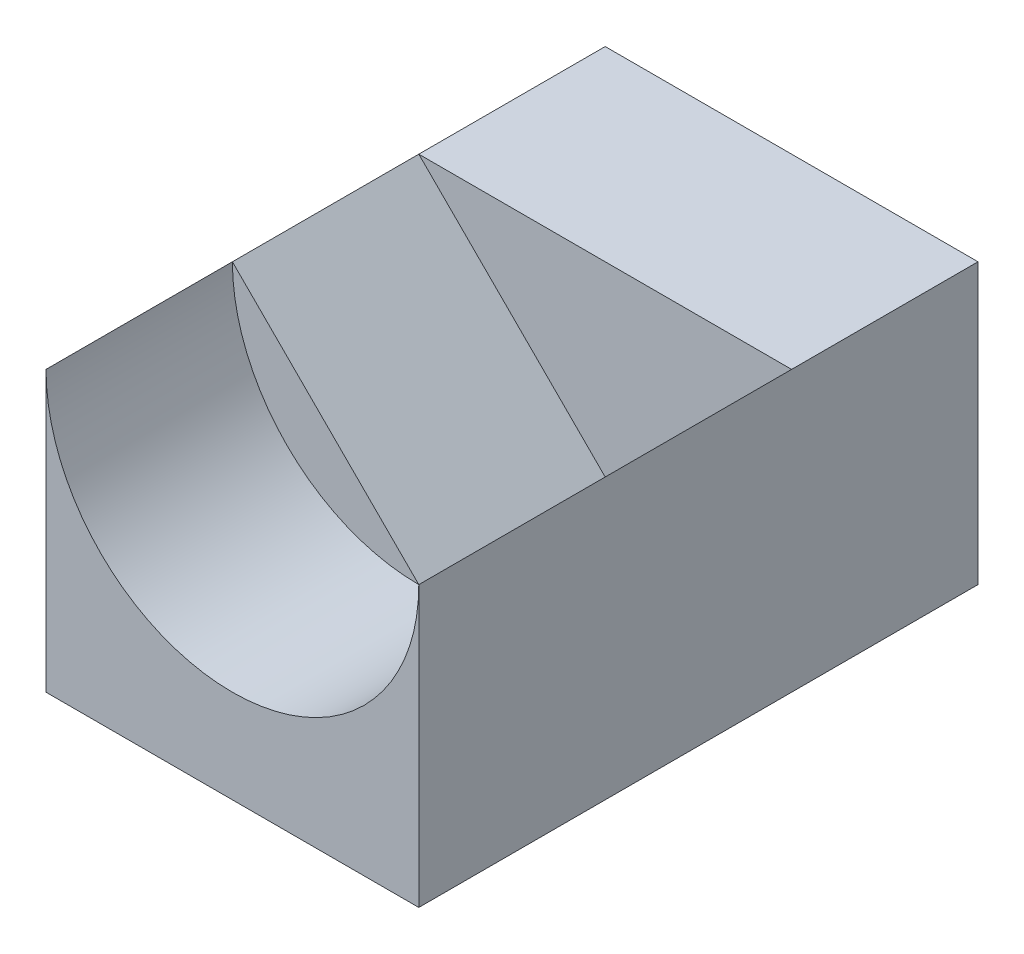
ISO-10303-21;
HEADER;
FILE_DESCRIPTION(('STEP AP214'),'2;1');
FILE_NAME('part.step','',(''),(''),'','','');
FILE_SCHEMA(('AUTOMOTIVE_DESIGN { 1 0 10303 214 1 1 1 1 }'));
ENDSEC;
DATA;
#1=APPLICATION_CONTEXT('core data for automotive mechanical design processes');
#2=APPLICATION_PROTOCOL_DEFINITION('international standard','automotive_design',2000,#1);
#3=PRODUCT_CONTEXT('',#1,'mechanical');
#4=PRODUCT('Part','Part','',(#3));
#5=PRODUCT_RELATED_PRODUCT_CATEGORY('part','',(#4));
#6=PRODUCT_DEFINITION_FORMATION('','',#4);
#7=PRODUCT_DEFINITION_CONTEXT('part definition',#1,'design');
#8=PRODUCT_DEFINITION('design','',#6,#7);
#9=PRODUCT_DEFINITION_SHAPE('','',#8);
#10=(LENGTH_UNIT() NAMED_UNIT(*) SI_UNIT(.MILLI.,.METRE.));
#11=(NAMED_UNIT(*) PLANE_ANGLE_UNIT() SI_UNIT($,.RADIAN.));
#12=(NAMED_UNIT(*) SI_UNIT($,.STERADIAN.) SOLID_ANGLE_UNIT());
#13=UNCERTAINTY_MEASURE_WITH_UNIT(LENGTH_MEASURE(1.E-05),#10,'distance_accuracy_value','');
#14=(GEOMETRIC_REPRESENTATION_CONTEXT(3) GLOBAL_UNCERTAINTY_ASSIGNED_CONTEXT((#13)) GLOBAL_UNIT_ASSIGNED_CONTEXT((#10,
#11,#12)) REPRESENTATION_CONTEXT('',''));
#15=CARTESIAN_POINT('',(0.,0.,0.));
#16=DIRECTION('',(0.,0.,1.));
#17=DIRECTION('',(1.,0.,0.));
#18=AXIS2_PLACEMENT_3D('',#15,#16,#17);
#19=CARTESIAN_POINT('',(-20.,30.,60.));
#20=DIRECTION('',(0.,-1.,0.));
#21=DIRECTION('',(0.,0.,-1.));
#22=AXIS2_PLACEMENT_3D('',#19,#20,#21);
#23=PLANE('',#22);
#24=DIRECTION('',(-1.,0.,0.));
#25=VECTOR('',#24,1.);
#26=CARTESIAN_POINT('',(-20.,30.,20.));
#27=LINE('',#26,#25);
#28=CARTESIAN_POINT('',(20.,30.,20.));
#29=VERTEX_POINT('',#28);
#30=CARTESIAN_POINT('',(-20.,30.,20.));
#31=VERTEX_POINT('',#30);
#32=EDGE_CURVE('E106',#29,#31,#27,.T.);
#33=ORIENTED_EDGE('',*,*,#32,.F.);
#34=DIRECTION('',(0.,0.,-1.));
#35=VECTOR('',#34,1.);
#36=CARTESIAN_POINT('',(20.,30.,60.));
#37=LINE('',#36,#35);
#38=CARTESIAN_POINT('',(20.,30.,0.));
#39=VERTEX_POINT('',#38);
#40=EDGE_CURVE('E142',#29,#39,#37,.T.);
#41=ORIENTED_EDGE('',*,*,#40,.T.);
#42=DIRECTION('',(-1.,0.,0.));
#43=VECTOR('',#42,1.);
#44=CARTESIAN_POINT('',(-20.,30.,0.));
#45=LINE('',#44,#43);
#46=CARTESIAN_POINT('',(-20.,30.,0.));
#47=VERTEX_POINT('',#46);
#48=EDGE_CURVE('E129',#39,#47,#45,.T.);
#49=ORIENTED_EDGE('',*,*,#48,.T.);
#50=DIRECTION('',(0.,0.,-1.));
#51=VECTOR('',#50,1.);
#52=CARTESIAN_POINT('',(-20.,30.,60.));
#53=LINE('',#52,#51);
#54=EDGE_CURVE('E75',#31,#47,#53,.T.);
#55=ORIENTED_EDGE('',*,*,#54,.F.);
#56=EDGE_LOOP('',(#33,#41,#49,#55));
#57=FACE_BOUND('',#56,.T.);
#58=ADVANCED_FACE('F30',(#57),#23,.F.);
#59=CARTESIAN_POINT('',(0.,30.,40.));
#60=DIRECTION('',(0.,0.,1.));
#61=DIRECTION('',(1.,0.,0.));
#62=AXIS2_PLACEMENT_3D('',#59,#60,#61);
#63=PLANE('',#62);
#64=DIRECTION('',(0.707106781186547,-0.707106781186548,0.));
#65=VECTOR('',#64,1.);
#66=CARTESIAN_POINT('',(0.,9.99999999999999,40.));
#67=LINE('',#66,#65);
#68=CARTESIAN_POINT('',(-20.,30.,40.));
#69=VERTEX_POINT('',#68);
#70=CARTESIAN_POINT('',(0.,9.99999999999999,40.));
#71=VERTEX_POINT('',#70);
#72=EDGE_CURVE('E45',#69,#71,#67,.T.);
#73=ORIENTED_EDGE('',*,*,#72,.F.);
#74=CARTESIAN_POINT('',(0.,30.,40.));
#75=DIRECTION('',(0.,0.,1.));
#76=DIRECTION('',(1.,0.,0.));
#77=AXIS2_PLACEMENT_3D('',#74,#75,#76);
#78=CIRCLE('',#77,20.);
#79=EDGE_CURVE('E123',#69,#71,#78,.T.);
#80=ORIENTED_EDGE('',*,*,#79,.T.);
#81=EDGE_LOOP('',(#73,#80));
#82=FACE_BOUND('',#81,.T.);
#83=ADVANCED_FACE('F165',(#82),#63,.T.);
#84=CARTESIAN_POINT('',(-20.,0.,60.));
#85=DIRECTION('',(1.,0.,0.));
#86=DIRECTION('',(0.,0.,-1.));
#87=AXIS2_PLACEMENT_3D('',#84,#85,#86);
#88=PLANE('',#87);
#89=DIRECTION('',(0.,-1.,0.));
#90=VECTOR('',#89,1.);
#91=CARTESIAN_POINT('',(-20.,0.,0.));
#92=LINE('',#91,#90);
#93=CARTESIAN_POINT('',(-20.,0.,0.));
#94=VERTEX_POINT('',#93);
#95=EDGE_CURVE('E126',#47,#94,#92,.T.);
#96=ORIENTED_EDGE('',*,*,#95,.T.);
#97=DIRECTION('',(0.,0.,-1.));
#98=VECTOR('',#97,1.);
#99=CARTESIAN_POINT('',(-20.,0.,60.));
#100=LINE('',#99,#98);
#101=CARTESIAN_POINT('',(-20.,0.,60.));
#102=VERTEX_POINT('',#101);
#103=EDGE_CURVE('E38',#102,#94,#100,.T.);
#104=ORIENTED_EDGE('',*,*,#103,.F.);
#105=DIRECTION('',(0.,-1.,0.));
#106=VECTOR('',#105,1.);
#107=CARTESIAN_POINT('',(-20.,0.,60.));
#108=LINE('',#107,#106);
#109=CARTESIAN_POINT('',(-20.,30.,60.));
#110=VERTEX_POINT('',#109);
#111=EDGE_CURVE('E127',#110,#102,#108,.T.);
#112=ORIENTED_EDGE('',*,*,#111,.F.);
#113=EDGE_CURVE('E54',#110,#69,#53,.T.);
#114=ORIENTED_EDGE('',*,*,#113,.T.);
#115=EDGE_CURVE('E143',#69,#31,#53,.T.);
#116=ORIENTED_EDGE('',*,*,#115,.T.);
#117=ORIENTED_EDGE('',*,*,#54,.T.);
#118=EDGE_LOOP('',(#96,#104,#112,#114,#116,#117));
#119=FACE_BOUND('',#118,.T.);
#120=ADVANCED_FACE('F32',(#119),#88,.F.);
#121=CARTESIAN_POINT('',(-20.,0.,60.));
#122=DIRECTION('',(0.,1.,0.));
#123=DIRECTION('',(0.,0.,1.));
#124=AXIS2_PLACEMENT_3D('',#121,#122,#123);
#125=PLANE('',#124);
#126=DIRECTION('',(1.,0.,0.));
#127=VECTOR('',#126,1.);
#128=CARTESIAN_POINT('',(-20.,0.,0.));
#129=LINE('',#128,#127);
#130=CARTESIAN_POINT('',(20.,0.,0.));
#131=VERTEX_POINT('',#130);
#132=EDGE_CURVE('E135',#94,#131,#129,.T.);
#133=ORIENTED_EDGE('',*,*,#132,.T.);
#134=DIRECTION('',(0.,0.,-1.));
#135=VECTOR('',#134,1.);
#136=CARTESIAN_POINT('',(20.,0.,60.));
#137=LINE('',#136,#135);
#138=CARTESIAN_POINT('',(20.,0.,60.));
#139=VERTEX_POINT('',#138);
#140=EDGE_CURVE('E147',#139,#131,#137,.T.);
#141=ORIENTED_EDGE('',*,*,#140,.F.);
#142=DIRECTION('',(1.,0.,0.));
#143=VECTOR('',#142,1.);
#144=CARTESIAN_POINT('',(-20.,0.,60.));
#145=LINE('',#144,#143);
#146=EDGE_CURVE('E81',#102,#139,#145,.T.);
#147=ORIENTED_EDGE('',*,*,#146,.F.);
#148=ORIENTED_EDGE('',*,*,#103,.T.);
#149=EDGE_LOOP('',(#133,#141,#147,#148));
#150=FACE_BOUND('',#149,.T.);
#151=ADVANCED_FACE('F150',(#150),#125,.F.);
#152=CARTESIAN_POINT('',(20.,0.,60.));
#153=DIRECTION('',(-1.,0.,0.));
#154=DIRECTION('',(0.,0.,1.));
#155=AXIS2_PLACEMENT_3D('',#152,#153,#154);
#156=PLANE('',#155);
#157=DIRECTION('',(0.,1.,0.));
#158=VECTOR('',#157,1.);
#159=CARTESIAN_POINT('',(20.,0.,0.));
#160=LINE('',#159,#158);
#161=EDGE_CURVE('E137',#131,#39,#160,.T.);
#162=ORIENTED_EDGE('',*,*,#161,.T.);
#163=ORIENTED_EDGE('',*,*,#40,.F.);
#164=CARTESIAN_POINT('',(20.,30.,40.));
#165=VERTEX_POINT('',#164);
#166=EDGE_CURVE('E112',#165,#29,#37,.T.);
#167=ORIENTED_EDGE('',*,*,#166,.F.);
#168=CARTESIAN_POINT('',(20.,30.,60.));
#169=VERTEX_POINT('',#168);
#170=EDGE_CURVE('E144',#169,#165,#37,.T.);
#171=ORIENTED_EDGE('',*,*,#170,.F.);
#172=DIRECTION('',(0.,1.,0.));
#173=VECTOR('',#172,1.);
#174=CARTESIAN_POINT('',(20.,0.,60.));
#175=LINE('',#174,#173);
#176=EDGE_CURVE('E131',#139,#169,#175,.T.);
#177=ORIENTED_EDGE('',*,*,#176,.F.);
#178=ORIENTED_EDGE('',*,*,#140,.T.);
#179=EDGE_LOOP('',(#162,#163,#167,#171,#177,#178));
#180=FACE_BOUND('',#179,.T.);
#181=ADVANCED_FACE('F159',(#180),#156,.F.);
#182=CARTESIAN_POINT('',(-20.,30.,60.));
#183=DIRECTION('',(0.,0.,-1.));
#184=DIRECTION('',(-1.,0.,0.));
#185=AXIS2_PLACEMENT_3D('',#182,#183,#184);
#186=PLANE('',#185);
#187=ORIENTED_EDGE('',*,*,#176,.T.);
#188=CARTESIAN_POINT('',(0.,30.,60.));
#189=DIRECTION('',(0.,0.,-1.));
#190=DIRECTION('',(-1.,0.,0.));
#191=AXIS2_PLACEMENT_3D('',#188,#189,#190);
#192=CIRCLE('',#191,20.);
#193=EDGE_CURVE('E11',#169,#110,#192,.T.);
#194=ORIENTED_EDGE('',*,*,#193,.T.);
#195=ORIENTED_EDGE('',*,*,#111,.T.);
#196=ORIENTED_EDGE('',*,*,#146,.T.);
#197=EDGE_LOOP('',(#187,#194,#195,#196));
#198=FACE_BOUND('',#197,.T.);
#199=ADVANCED_FACE('F163',(#198),#186,.F.);
#200=CARTESIAN_POINT('',(-20.,30.,0.));
#201=DIRECTION('',(0.,0.,-1.));
#202=DIRECTION('',(-1.,0.,0.));
#203=AXIS2_PLACEMENT_3D('',#200,#201,#202);
#204=PLANE('',#203);
#205=ORIENTED_EDGE('',*,*,#95,.F.);
#206=ORIENTED_EDGE('',*,*,#48,.F.);
#207=ORIENTED_EDGE('',*,*,#161,.F.);
#208=ORIENTED_EDGE('',*,*,#132,.F.);
#209=EDGE_LOOP('',(#205,#206,#207,#208));
#210=FACE_BOUND('',#209,.T.);
#211=ADVANCED_FACE('F155',(#210),#204,.T.);
#212=DIRECTION('',(0.707106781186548,0.707106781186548,0.));
#213=VECTOR('',#212,1.);
#214=CARTESIAN_POINT('',(20.,30.,40.));
#215=LINE('',#214,#213);
#216=EDGE_CURVE('E117',#71,#165,#215,.T.);
#217=ORIENTED_EDGE('',*,*,#216,.F.);
#218=EDGE_CURVE('E105',#71,#165,#78,.T.);
#219=ORIENTED_EDGE('',*,*,#218,.T.);
#220=EDGE_LOOP('',(#217,#219));
#221=FACE_BOUND('',#220,.T.);
#222=ADVANCED_FACE('F170',(#221),#63,.T.);
#223=CARTESIAN_POINT('',(0.,30.,40.));
#224=DIRECTION('',(0.,0.,1.));
#225=DIRECTION('',(1.,0.,0.));
#226=AXIS2_PLACEMENT_3D('',#223,#224,#225);
#227=CYLINDRICAL_SURFACE('',#226,20.);
#228=ORIENTED_EDGE('',*,*,#79,.F.);
#229=ORIENTED_EDGE('',*,*,#113,.F.);
#230=ORIENTED_EDGE('',*,*,#193,.F.);
#231=ORIENTED_EDGE('',*,*,#170,.T.);
#232=ORIENTED_EDGE('',*,*,#218,.F.);
#233=EDGE_LOOP('',(#228,#229,#230,#231,#232));
#234=FACE_BOUND('',#233,.T.);
#235=ADVANCED_FACE('F167',(#234),#227,.F.);
#236=CARTESIAN_POINT('',(0.,9.99999999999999,20.));
#237=DIRECTION('',(-0.707106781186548,-0.707106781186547,0.));
#238=DIRECTION('',(0.707106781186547,-0.707106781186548,0.));
#239=AXIS2_PLACEMENT_3D('',#236,#237,#238);
#240=PLANE('',#239);
#241=ORIENTED_EDGE('',*,*,#72,.T.);
#242=DIRECTION('',(0.,0.,1.));
#243=VECTOR('',#242,1.);
#244=CARTESIAN_POINT('',(0.,9.99999999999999,20.));
#245=LINE('',#244,#243);
#246=CARTESIAN_POINT('',(0.,9.99999999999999,20.));
#247=VERTEX_POINT('',#246);
#248=EDGE_CURVE('E97',#247,#71,#245,.T.);
#249=ORIENTED_EDGE('',*,*,#248,.F.);
#250=DIRECTION('',(0.707106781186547,-0.707106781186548,0.));
#251=VECTOR('',#250,1.);
#252=CARTESIAN_POINT('',(0.,9.99999999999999,20.));
#253=LINE('',#252,#251);
#254=EDGE_CURVE('E101',#31,#247,#253,.T.);
#255=ORIENTED_EDGE('',*,*,#254,.F.);
#256=ORIENTED_EDGE('',*,*,#115,.F.);
#257=EDGE_LOOP('',(#241,#249,#255,#256));
#258=FACE_BOUND('',#257,.T.);
#259=ADVANCED_FACE('F99',(#258),#240,.F.);
#260=CARTESIAN_POINT('',(20.,30.,20.));
#261=DIRECTION('',(0.707106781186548,-0.707106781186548,0.));
#262=DIRECTION('',(0.707106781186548,0.707106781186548,0.));
#263=AXIS2_PLACEMENT_3D('',#260,#261,#262);
#264=PLANE('',#263);
#265=ORIENTED_EDGE('',*,*,#216,.T.);
#266=ORIENTED_EDGE('',*,*,#166,.T.);
#267=DIRECTION('',(0.707106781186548,0.707106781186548,0.));
#268=VECTOR('',#267,1.);
#269=CARTESIAN_POINT('',(20.,30.,20.));
#270=LINE('',#269,#268);
#271=EDGE_CURVE('E109',#247,#29,#270,.T.);
#272=ORIENTED_EDGE('',*,*,#271,.F.);
#273=ORIENTED_EDGE('',*,*,#248,.T.);
#274=EDGE_LOOP('',(#265,#266,#272,#273));
#275=FACE_BOUND('',#274,.T.);
#276=ADVANCED_FACE('F110',(#275),#264,.F.);
#277=CARTESIAN_POINT('',(0.,9.99999999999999,20.));
#278=DIRECTION('',(0.,0.,1.));
#279=DIRECTION('',(1.,0.,0.));
#280=AXIS2_PLACEMENT_3D('',#277,#278,#279);
#281=PLANE('',#280);
#282=ORIENTED_EDGE('',*,*,#254,.T.);
#283=ORIENTED_EDGE('',*,*,#271,.T.);
#284=ORIENTED_EDGE('',*,*,#32,.T.);
#285=EDGE_LOOP('',(#282,#283,#284));
#286=FACE_BOUND('',#285,.T.);
#287=ADVANCED_FACE('F116',(#286),#281,.T.);
#288=CLOSED_SHELL('',(#58,#83,#120,#151,#181,#199,#211,#222,#235,#259,#276,#287));
#289=MANIFOLD_SOLID_BREP('B2',#288);
#290=ADVANCED_BREP_SHAPE_REPRESENTATION('',(#18,#289),#14);
#291=SHAPE_DEFINITION_REPRESENTATION(#9,#290);
ENDSEC;
END-ISO-10303-21;
